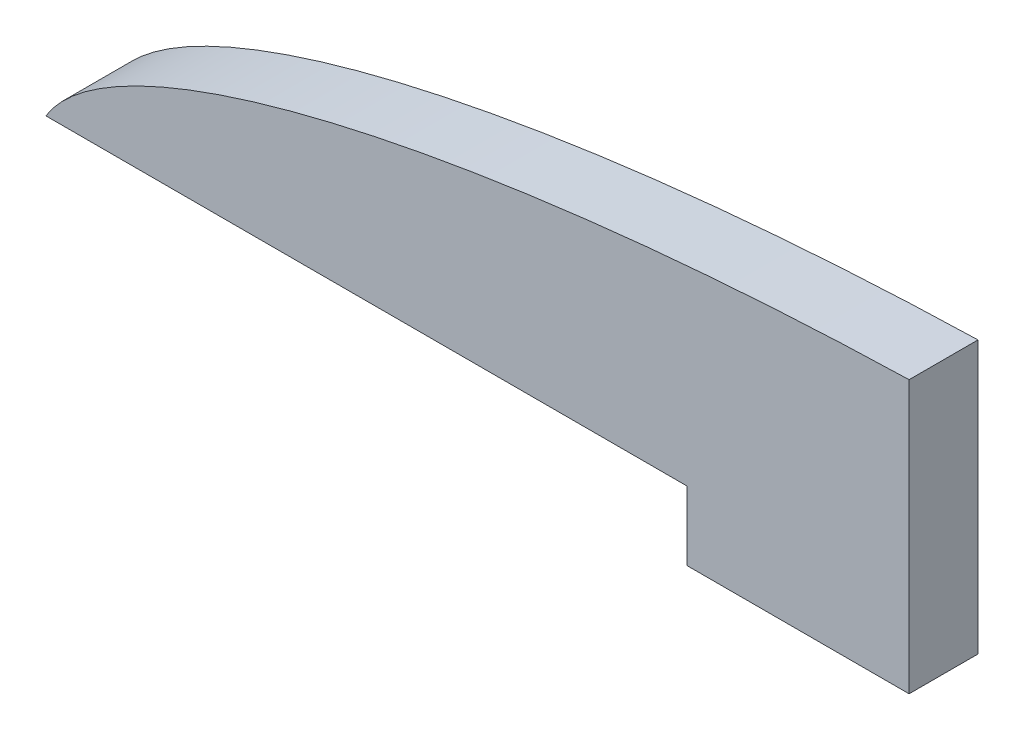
ISO-10303-21;
HEADER;
FILE_DESCRIPTION(('STEP AP214'),'2;1');
FILE_NAME('part.step','',(''),(''),'','','');
FILE_SCHEMA(('AUTOMOTIVE_DESIGN { 1 0 10303 214 1 1 1 1 }'));
ENDSEC;
DATA;
#1=APPLICATION_CONTEXT('core data for automotive mechanical design processes');
#2=APPLICATION_PROTOCOL_DEFINITION('international standard','automotive_design',2000,#1);
#3=PRODUCT_CONTEXT('',#1,'mechanical');
#4=PRODUCT('Part','Part','',(#3));
#5=PRODUCT_RELATED_PRODUCT_CATEGORY('part','',(#4));
#6=PRODUCT_DEFINITION_FORMATION('','',#4);
#7=PRODUCT_DEFINITION_CONTEXT('part definition',#1,'design');
#8=PRODUCT_DEFINITION('design','',#6,#7);
#9=PRODUCT_DEFINITION_SHAPE('','',#8);
#10=(LENGTH_UNIT() NAMED_UNIT(*) SI_UNIT(.MILLI.,.METRE.));
#11=(NAMED_UNIT(*) PLANE_ANGLE_UNIT() SI_UNIT($,.RADIAN.));
#12=(NAMED_UNIT(*) SI_UNIT($,.STERADIAN.) SOLID_ANGLE_UNIT());
#13=UNCERTAINTY_MEASURE_WITH_UNIT(LENGTH_MEASURE(1.E-05),#10,'distance_accuracy_value','');
#14=(GEOMETRIC_REPRESENTATION_CONTEXT(3) GLOBAL_UNCERTAINTY_ASSIGNED_CONTEXT((#13)) GLOBAL_UNIT_ASSIGNED_CONTEXT((#10,
#11,#12)) REPRESENTATION_CONTEXT('',''));
#15=CARTESIAN_POINT('',(0.,0.,0.));
#16=DIRECTION('',(0.,0.,1.));
#17=DIRECTION('',(1.,0.,0.));
#18=AXIS2_PLACEMENT_3D('',#15,#16,#17);
#19=CARTESIAN_POINT('',(0.,0.,3.175));
#20=DIRECTION('',(0.,0.,1.));
#21=DIRECTION('',(-1.,0.,0.));
#22=AXIS2_PLACEMENT_3D('',#19,#20,#21);
#23=ELLIPSE('',#22,45.,11.0089115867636);
#24=DIRECTION('',(0.,0.,-1.));
#25=VECTOR('',#24,1.);
#26=SURFACE_OF_LINEAR_EXTRUSION('',#23,#25);
#27=CARTESIAN_POINT('',(0.,0.,0.));
#28=DIRECTION('',(0.,0.,1.));
#29=DIRECTION('',(-1.,0.,0.));
#30=AXIS2_PLACEMENT_3D('',#27,#28,#29);
#31=ELLIPSE('',#30,45.,11.0089115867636);
#32=CARTESIAN_POINT('',(-4.7625,10.9470842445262,0.));
#33=VERTEX_POINT('',#32);
#34=CARTESIAN_POINT('',(-44.5296764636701,1.5875,0.));
#35=VERTEX_POINT('',#34);
#36=EDGE_CURVE('E109',#33,#35,#31,.T.);
#37=ORIENTED_EDGE('',*,*,#36,.T.);
#38=DIRECTION('',(0.,0.,-1.));
#39=VECTOR('',#38,1.);
#40=CARTESIAN_POINT('',(-44.5296764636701,1.5875,3.175));
#41=LINE('',#40,#39);
#42=CARTESIAN_POINT('',(-44.5296764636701,1.5875,3.175));
#43=VERTEX_POINT('',#42);
#44=EDGE_CURVE('E11',#43,#35,#41,.T.);
#45=ORIENTED_EDGE('',*,*,#44,.F.);
#46=CARTESIAN_POINT('',(-4.7625,10.9470842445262,3.175));
#47=VERTEX_POINT('',#46);
#48=EDGE_CURVE('E118',#47,#43,#23,.T.);
#49=ORIENTED_EDGE('',*,*,#48,.F.);
#50=DIRECTION('',(0.,0.,-1.));
#51=VECTOR('',#50,1.);
#52=CARTESIAN_POINT('',(-4.7625,10.9470842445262,3.175));
#53=LINE('',#52,#51);
#54=EDGE_CURVE('E105',#47,#33,#53,.T.);
#55=ORIENTED_EDGE('',*,*,#54,.T.);
#56=EDGE_LOOP('',(#37,#45,#49,#55));
#57=FACE_BOUND('',#56,.T.);
#58=ADVANCED_FACE('F33',(#57),#26,.F.);
#59=CARTESIAN_POINT('',(-15.,1.5875,3.175));
#60=DIRECTION('',(0.,1.,0.));
#61=DIRECTION('',(-1.,0.,0.));
#62=AXIS2_PLACEMENT_3D('',#59,#60,#61);
#63=PLANE('',#62);
#64=DIRECTION('',(1.,0.,0.));
#65=VECTOR('',#64,1.);
#66=CARTESIAN_POINT('',(-15.,1.5875,0.));
#67=LINE('',#66,#65);
#68=CARTESIAN_POINT('',(-15.,1.5875,0.));
#69=VERTEX_POINT('',#68);
#70=EDGE_CURVE('E112',#35,#69,#67,.T.);
#71=ORIENTED_EDGE('',*,*,#70,.T.);
#72=DIRECTION('',(0.,0.,-1.));
#73=VECTOR('',#72,1.);
#74=CARTESIAN_POINT('',(-15.,1.5875,3.175));
#75=LINE('',#74,#73);
#76=CARTESIAN_POINT('',(-15.,1.5875,3.175));
#77=VERTEX_POINT('',#76);
#78=EDGE_CURVE('E42',#77,#69,#75,.T.);
#79=ORIENTED_EDGE('',*,*,#78,.F.);
#80=DIRECTION('',(1.,0.,0.));
#81=VECTOR('',#80,1.);
#82=CARTESIAN_POINT('',(-15.,1.5875,3.175));
#83=LINE('',#82,#81);
#84=EDGE_CURVE('E82',#43,#77,#83,.T.);
#85=ORIENTED_EDGE('',*,*,#84,.F.);
#86=ORIENTED_EDGE('',*,*,#44,.T.);
#87=EDGE_LOOP('',(#71,#79,#85,#86));
#88=FACE_BOUND('',#87,.T.);
#89=ADVANCED_FACE('F126',(#88),#63,.F.);
#90=CARTESIAN_POINT('',(-15.,-1.5875,3.175));
#91=DIRECTION('',(1.,0.,0.));
#92=DIRECTION('',(0.,0.,-1.));
#93=AXIS2_PLACEMENT_3D('',#90,#91,#92);
#94=PLANE('',#93);
#95=DIRECTION('',(0.,-1.,0.));
#96=VECTOR('',#95,1.);
#97=CARTESIAN_POINT('',(-15.,-1.5875,0.));
#98=LINE('',#97,#96);
#99=CARTESIAN_POINT('',(-15.,-1.5875,0.));
#100=VERTEX_POINT('',#99);
#101=EDGE_CURVE('E99',#69,#100,#98,.T.);
#102=ORIENTED_EDGE('',*,*,#101,.T.);
#103=DIRECTION('',(0.,0.,-1.));
#104=VECTOR('',#103,1.);
#105=CARTESIAN_POINT('',(-15.,-1.5875,3.175));
#106=LINE('',#105,#104);
#107=CARTESIAN_POINT('',(-15.,-1.5875,3.175));
#108=VERTEX_POINT('',#107);
#109=EDGE_CURVE('E96',#108,#100,#106,.T.);
#110=ORIENTED_EDGE('',*,*,#109,.F.);
#111=DIRECTION('',(0.,-1.,0.));
#112=VECTOR('',#111,1.);
#113=CARTESIAN_POINT('',(-15.,-1.5875,3.175));
#114=LINE('',#113,#112);
#115=EDGE_CURVE('E86',#77,#108,#114,.T.);
#116=ORIENTED_EDGE('',*,*,#115,.F.);
#117=ORIENTED_EDGE('',*,*,#78,.T.);
#118=EDGE_LOOP('',(#102,#110,#116,#117));
#119=FACE_BOUND('',#118,.T.);
#120=ADVANCED_FACE('F97',(#119),#94,.F.);
#121=CARTESIAN_POINT('',(-4.7625,-1.5875,3.175));
#122=DIRECTION('',(0.,1.,0.));
#123=DIRECTION('',(-1.,0.,0.));
#124=AXIS2_PLACEMENT_3D('',#121,#122,#123);
#125=PLANE('',#124);
#126=DIRECTION('',(1.,0.,0.));
#127=VECTOR('',#126,1.);
#128=CARTESIAN_POINT('',(-4.7625,-1.5875,0.));
#129=LINE('',#128,#127);
#130=CARTESIAN_POINT('',(-4.7625,-1.5875,0.));
#131=VERTEX_POINT('',#130);
#132=EDGE_CURVE('E115',#100,#131,#129,.T.);
#133=ORIENTED_EDGE('',*,*,#132,.T.);
#134=DIRECTION('',(0.,0.,-1.));
#135=VECTOR('',#134,1.);
#136=CARTESIAN_POINT('',(-4.7625,-1.5875,3.175));
#137=LINE('',#136,#135);
#138=CARTESIAN_POINT('',(-4.7625,-1.5875,3.175));
#139=VERTEX_POINT('',#138);
#140=EDGE_CURVE('E101',#139,#131,#137,.T.);
#141=ORIENTED_EDGE('',*,*,#140,.F.);
#142=DIRECTION('',(1.,0.,0.));
#143=VECTOR('',#142,1.);
#144=CARTESIAN_POINT('',(-4.7625,-1.5875,3.175));
#145=LINE('',#144,#143);
#146=EDGE_CURVE('E90',#108,#139,#145,.T.);
#147=ORIENTED_EDGE('',*,*,#146,.F.);
#148=ORIENTED_EDGE('',*,*,#109,.T.);
#149=EDGE_LOOP('',(#133,#141,#147,#148));
#150=FACE_BOUND('',#149,.T.);
#151=ADVANCED_FACE('F103',(#150),#125,.F.);
#152=CARTESIAN_POINT('',(-4.7625,0.,3.175));
#153=DIRECTION('',(-1.,0.,0.));
#154=DIRECTION('',(0.,0.,1.));
#155=AXIS2_PLACEMENT_3D('',#152,#153,#154);
#156=PLANE('',#155);
#157=DIRECTION('',(0.,1.,0.));
#158=VECTOR('',#157,1.);
#159=CARTESIAN_POINT('',(-4.7625,0.,0.));
#160=LINE('',#159,#158);
#161=EDGE_CURVE('E70',#131,#33,#160,.T.);
#162=ORIENTED_EDGE('',*,*,#161,.T.);
#163=ORIENTED_EDGE('',*,*,#54,.F.);
#164=DIRECTION('',(0.,1.,0.));
#165=VECTOR('',#164,1.);
#166=CARTESIAN_POINT('',(-4.7625,0.,3.175));
#167=LINE('',#166,#165);
#168=EDGE_CURVE('E50',#139,#47,#167,.T.);
#169=ORIENTED_EDGE('',*,*,#168,.F.);
#170=ORIENTED_EDGE('',*,*,#140,.T.);
#171=EDGE_LOOP('',(#162,#163,#169,#170));
#172=FACE_BOUND('',#171,.T.);
#173=ADVANCED_FACE('F121',(#172),#156,.F.);
#174=CARTESIAN_POINT('',(0.,0.,3.175));
#175=DIRECTION('',(0.,0.,1.));
#176=DIRECTION('',(1.,0.,0.));
#177=AXIS2_PLACEMENT_3D('',#174,#175,#176);
#178=PLANE('',#177);
#179=ORIENTED_EDGE('',*,*,#48,.T.);
#180=ORIENTED_EDGE('',*,*,#84,.T.);
#181=ORIENTED_EDGE('',*,*,#115,.T.);
#182=ORIENTED_EDGE('',*,*,#146,.T.);
#183=ORIENTED_EDGE('',*,*,#168,.T.);
#184=EDGE_LOOP('',(#179,#180,#181,#182,#183));
#185=FACE_BOUND('',#184,.T.);
#186=ADVANCED_FACE('F88',(#185),#178,.T.);
#187=CARTESIAN_POINT('',(0.,0.,0.));
#188=DIRECTION('',(0.,0.,1.));
#189=DIRECTION('',(1.,0.,0.));
#190=AXIS2_PLACEMENT_3D('',#187,#188,#189);
#191=PLANE('',#190);
#192=ORIENTED_EDGE('',*,*,#36,.F.);
#193=ORIENTED_EDGE('',*,*,#161,.F.);
#194=ORIENTED_EDGE('',*,*,#132,.F.);
#195=ORIENTED_EDGE('',*,*,#101,.F.);
#196=ORIENTED_EDGE('',*,*,#70,.F.);
#197=EDGE_LOOP('',(#192,#193,#194,#195,#196));
#198=FACE_BOUND('',#197,.T.);
#199=ADVANCED_FACE('F120',(#198),#191,.F.);
#200=CLOSED_SHELL('',(#58,#89,#120,#151,#173,#186,#199));
#201=MANIFOLD_SOLID_BREP('B2',#200);
#202=ADVANCED_BREP_SHAPE_REPRESENTATION('',(#18,#201),#14);
#203=SHAPE_DEFINITION_REPRESENTATION(#9,#202);
ENDSEC;
END-ISO-10303-21;
